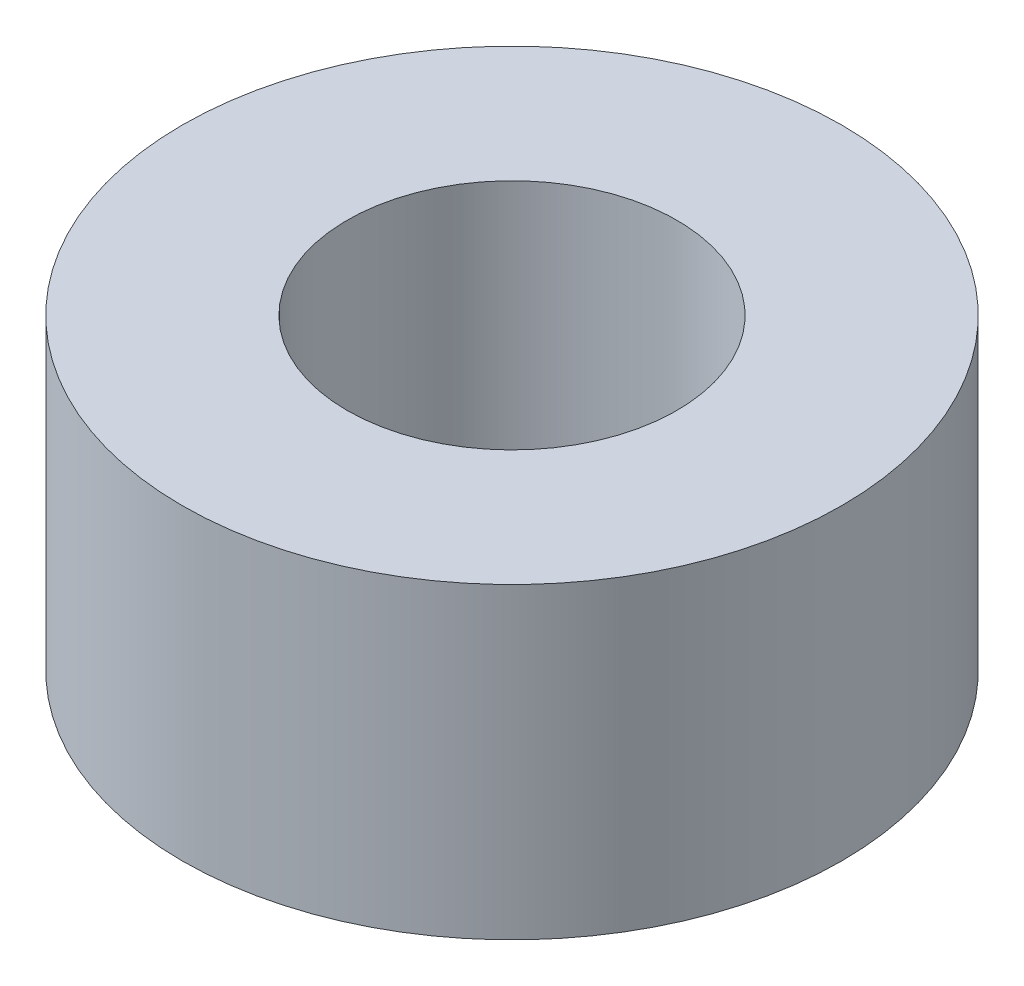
ISO-10303-21;
HEADER;
FILE_DESCRIPTION(('STEP AP214'),'2;1');
FILE_NAME('part.step','',(''),(''),'','','');
FILE_SCHEMA(('AUTOMOTIVE_DESIGN { 1 0 10303 214 1 1 1 1 }'));
ENDSEC;
DATA;
#1=APPLICATION_CONTEXT('core data for automotive mechanical design processes');
#2=APPLICATION_PROTOCOL_DEFINITION('international standard','automotive_design',2000,#1);
#3=PRODUCT_CONTEXT('',#1,'mechanical');
#4=PRODUCT('Part','Part','',(#3));
#5=PRODUCT_RELATED_PRODUCT_CATEGORY('part','',(#4));
#6=PRODUCT_DEFINITION_FORMATION('','',#4);
#7=PRODUCT_DEFINITION_CONTEXT('part definition',#1,'design');
#8=PRODUCT_DEFINITION('design','',#6,#7);
#9=PRODUCT_DEFINITION_SHAPE('','',#8);
#10=(LENGTH_UNIT() NAMED_UNIT(*) SI_UNIT(.MILLI.,.METRE.));
#11=(NAMED_UNIT(*) PLANE_ANGLE_UNIT() SI_UNIT($,.RADIAN.));
#12=(NAMED_UNIT(*) SI_UNIT($,.STERADIAN.) SOLID_ANGLE_UNIT());
#13=UNCERTAINTY_MEASURE_WITH_UNIT(LENGTH_MEASURE(1.E-05),#10,'distance_accuracy_value','');
#14=(GEOMETRIC_REPRESENTATION_CONTEXT(3) GLOBAL_UNCERTAINTY_ASSIGNED_CONTEXT((#13)) GLOBAL_UNIT_ASSIGNED_CONTEXT((#10,
#11,#12)) REPRESENTATION_CONTEXT('',''));
#15=CARTESIAN_POINT('',(0.,0.,0.));
#16=DIRECTION('',(0.,0.,1.));
#17=DIRECTION('',(1.,0.,0.));
#18=AXIS2_PLACEMENT_3D('',#15,#16,#17);
#19=CARTESIAN_POINT('',(0.,8.89,0.));
#20=DIRECTION('',(0.,1.,0.));
#21=DIRECTION('',(0.,0.,1.));
#22=AXIS2_PLACEMENT_3D('',#19,#20,#21);
#23=PLANE('',#22);
#24=CARTESIAN_POINT('',(0.,8.89,0.));
#25=DIRECTION('',(0.,1.,0.));
#26=DIRECTION('',(0.,0.,1.));
#27=AXIS2_PLACEMENT_3D('',#24,#25,#26);
#28=CIRCLE('',#27,9.525);
#29=CARTESIAN_POINT('',(0.,8.89,9.525));
#30=VERTEX_POINT('',#29);
#31=EDGE_CURVE('E10',#30,#30,#28,.T.);
#32=ORIENTED_EDGE('',*,*,#31,.T.);
#33=EDGE_LOOP('',(#32));
#34=FACE_BOUND('',#33,.T.);
#35=CARTESIAN_POINT('',(0.,8.89,0.));
#36=DIRECTION('',(0.,1.,0.));
#37=DIRECTION('',(0.,0.,1.));
#38=AXIS2_PLACEMENT_3D('',#35,#36,#37);
#39=CIRCLE('',#38,4.7625);
#40=CARTESIAN_POINT('',(0.,8.89,4.7625));
#41=VERTEX_POINT('',#40);
#42=EDGE_CURVE('E35',#41,#41,#39,.T.);
#43=ORIENTED_EDGE('',*,*,#42,.F.);
#44=EDGE_LOOP('',(#43));
#45=FACE_BOUND('',#44,.T.);
#46=ADVANCED_FACE('F24',(#34,#45),#23,.T.);
#47=CARTESIAN_POINT('',(0.,0.,0.));
#48=DIRECTION('',(0.,1.,0.));
#49=DIRECTION('',(0.,0.,1.));
#50=AXIS2_PLACEMENT_3D('',#47,#48,#49);
#51=PLANE('',#50);
#52=CARTESIAN_POINT('',(0.,0.,0.));
#53=DIRECTION('',(0.,1.,0.));
#54=DIRECTION('',(0.,0.,1.));
#55=AXIS2_PLACEMENT_3D('',#52,#53,#54);
#56=CIRCLE('',#55,9.525);
#57=CARTESIAN_POINT('',(0.,0.,9.525));
#58=VERTEX_POINT('',#57);
#59=EDGE_CURVE('E31',#58,#58,#56,.T.);
#60=ORIENTED_EDGE('',*,*,#59,.F.);
#61=EDGE_LOOP('',(#60));
#62=FACE_BOUND('',#61,.T.);
#63=CARTESIAN_POINT('',(0.,0.,0.));
#64=DIRECTION('',(0.,1.,0.));
#65=DIRECTION('',(0.,0.,1.));
#66=AXIS2_PLACEMENT_3D('',#63,#64,#65);
#67=CIRCLE('',#66,4.7625);
#68=CARTESIAN_POINT('',(0.,0.,4.7625));
#69=VERTEX_POINT('',#68);
#70=EDGE_CURVE('E39',#69,#69,#67,.T.);
#71=ORIENTED_EDGE('',*,*,#70,.T.);
#72=EDGE_LOOP('',(#71));
#73=FACE_BOUND('',#72,.T.);
#74=ADVANCED_FACE('F45',(#62,#73),#51,.F.);
#75=CARTESIAN_POINT('',(0.,8.89,0.));
#76=DIRECTION('',(0.,-1.,0.));
#77=DIRECTION('',(0.,0.,-1.));
#78=AXIS2_PLACEMENT_3D('',#75,#76,#77);
#79=CYLINDRICAL_SURFACE('',#78,9.525);
#80=ORIENTED_EDGE('',*,*,#31,.F.);
#81=EDGE_LOOP('',(#80));
#82=FACE_BOUND('',#81,.T.);
#83=ORIENTED_EDGE('',*,*,#59,.T.);
#84=EDGE_LOOP('',(#83));
#85=FACE_BOUND('',#84,.T.);
#86=ADVANCED_FACE('F26',(#82,#85),#79,.T.);
#87=CARTESIAN_POINT('',(0.,8.89,0.));
#88=DIRECTION('',(0.,-1.,0.));
#89=DIRECTION('',(0.,0.,-1.));
#90=AXIS2_PLACEMENT_3D('',#87,#88,#89);
#91=CYLINDRICAL_SURFACE('',#90,4.7625);
#92=ORIENTED_EDGE('',*,*,#42,.T.);
#93=EDGE_LOOP('',(#92));
#94=FACE_BOUND('',#93,.T.);
#95=ORIENTED_EDGE('',*,*,#70,.F.);
#96=EDGE_LOOP('',(#95));
#97=FACE_BOUND('',#96,.T.);
#98=ADVANCED_FACE('F47',(#94,#97),#91,.F.);
#99=CLOSED_SHELL('',(#46,#74,#86,#98));
#100=MANIFOLD_SOLID_BREP('B2',#99);
#101=ADVANCED_BREP_SHAPE_REPRESENTATION('',(#18,#100),#14);
#102=SHAPE_DEFINITION_REPRESENTATION(#9,#101);
ENDSEC;
END-ISO-10303-21;
